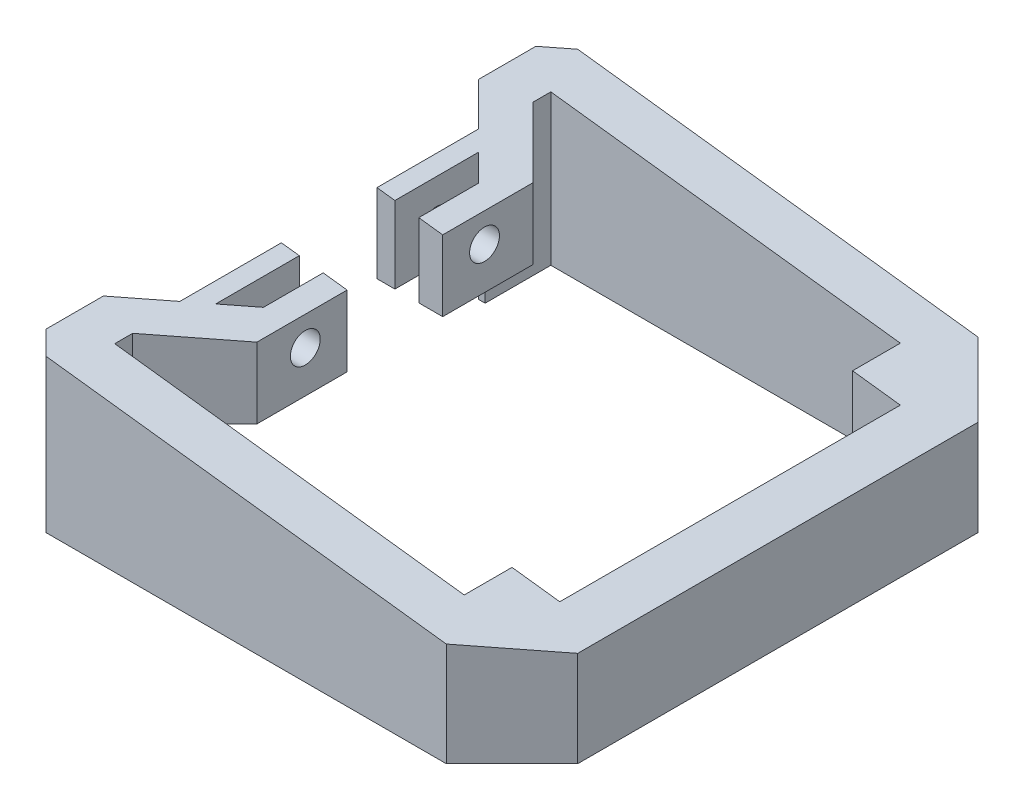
from build123d import *

# Parameters (mm, degrees)
SKETCH1_R                      = 1.1
BOSS_EXTRUDE1_DEPTH            = 6
BOSS_EXTRUDE2_DEPTH            = 7
SKETCH4_R                      = 1.25
CUT_EXTRUDE1_DEPTH             = 2
CUT_EXTRUDE3_REACH             = 55.38
SKETCH7_W                      = 8
SKETCH7_H                      = 13
CUT_EXTRUDE3_DIRECTION_2_DEPTH = 6
SKETCH8_R                      = 0.75
CUT_EXTRUDE4_DEPTH             = 2
CUT_EXTRUDE5_DEPTH             = 61.582588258
CUT_EXTRUDE6_DEPTH             = 6


with BuildPart() as part:
    # Sketch1 → Boss-Extrude1 (new body)
    with BuildSketch(Plane(origin=(0, 0, 0), x_dir=(1, 0, 0), z_dir=(0, 1, 0))):
        Polygon((39, 0), (39, -33.5), (33.5, -39), (0, -39), (-1.75, -37.25), (-1.75, -29.5), (1.45, -26.3), (1.45, -7.2), (-1.75, -4), (-1.75, 3.75), (0, 5.5), (33.5, 5.5), align=None)
        with Locations(Location((0, 0, 0), (0, 0, 270))):
            Circle(SKETCH1_R, mode=Mode.SUBTRACT)
        with Locations(Location((33.5, 0, 0), (0, 0, 270))):
            Circle(SKETCH1_R, mode=Mode.SUBTRACT)
        with Locations(Location((0, -33.5, 0), (0, 0, 270))):
            Circle(SKETCH1_R, mode=Mode.SUBTRACT)
        with Locations(Location((33.5, -33.5, 0), (0, 0, 270))):
            Circle(SKETCH1_R, mode=Mode.SUBTRACT)
        Polygon((31, 1.5), (31, -2.5), (35, -2.5), (35, -31), (31, -31), (31, -35), (1.75, -35), (1.75, -33.5), (6.95, -28.3), (6.95, -5.2), (1.75, 0), (1.75, 1.5), align=None, mode=Mode.SUBTRACT)
        Polygon((4.95, -22.8), (4.95, -10.7), (2.95, -8.7), (2.95, -24.8), align=None, mode=Mode.SUBTRACT)
    extrude(amount=BOSS_EXTRUDE1_DEPTH)

    # Sketch2 → Boss-Extrude2 (add)
    with BuildSketch(Plane(origin=(0, 6, 0), x_dir=(1, 0, 0), z_dir=(0, 1, 0))):
        Polygon((0, 5.5), (-1.75, 3.75), (-1.75, -1.05), (1.45, -4.25), (1.45, -29.25), (-1.75, -32.45), (-1.75, -37.25), (0, -39), (33.5, -39), (39, -33.5), (39, 0), (33.5, 5.5), align=None)
        Polygon((4.95, -7.75), (4.95, -25.75), (2.95, -27.75), (2.95, -5.75), align=None, mode=Mode.SUBTRACT)
        Polygon((1.75, -33.5), (1.75, -35), (31, -35), (31, -31), (35, -31), (35, -2.5), (31, -2.5), (31, 1.5), (1.75, 1.5), (1.75, 0), (6.95, -5.2), (6.95, -28.3), align=None, mode=Mode.SUBTRACT)
    extrude(amount=BOSS_EXTRUDE2_DEPTH)

    # Sketch4 → Cut-Extrude1 (cut)
    with BuildSketch(Plane(origin=(6.95, 0, 0), x_dir=(0, 0, -1), z_dir=(1, 0, 0))):
        with Locations((-24.25, 9.5)):
            Circle(SKETCH4_R)
        with Locations((-9.25, 9.5)):
            Circle(SKETCH4_R)
    extrude(amount=-CUT_EXTRUDE1_DEPTH, mode=Mode.SUBTRACT)

    # Sketch7 → Cut-Extrude3 (cut, up to next)
    with BuildSketch(Plane.ZY.offset(-4.95), mode=Mode.PRIVATE) as cut_extrude3_sk1:
        with Locations((16.75, 6.5)):
            Rectangle(SKETCH7_W, SKETCH7_H)
    cut_extrude3_tool1 = extrude(cut_extrude3_sk1.sketch, amount=-CUT_EXTRUDE3_REACH, mode=Mode.PRIVATE) & part.part
    add(cut_extrude3_tool1.solids().sort_by_distance((4.95, 6.5, 16.75))[0], mode=Mode.SUBTRACT)

    # Sketch7 → Cut-Extrude3 direction 2 (cut)
    with BuildSketch(Plane.ZY.offset(-4.95)):
        with Locations((16.75, 6.5)):
            Rectangle(SKETCH7_W, SKETCH7_H)
    extrude(amount=CUT_EXTRUDE3_DIRECTION_2_DEPTH, mode=Mode.SUBTRACT)

    # Sketch8 → Cut-Extrude4 (cut)
    with BuildSketch(Plane(origin=(2.95, 0, 0), x_dir=(0, 0, -1), z_dir=(1, 0, 0))):
        with Locations((-24.25, 9.5)):
            Circle(SKETCH8_R)
        with Locations((-9.25, 9.5)):
            Circle(SKETCH8_R)
    extrude(amount=-CUT_EXTRUDE4_DEPTH, mode=Mode.SUBTRACT)

    # Sketch9 → Cut-Extrude5 (cut, through all)
    with BuildSketch(Plane.XY.offset(39)):
        Polygon((-1.75, 13), (39, 8), (39, 13), align=None)
    extrude(amount=-CUT_EXTRUDE5_DEPTH, mode=Mode.SUBTRACT)

    # Sketch10 → Cut-Extrude6 (cut)
    with BuildSketch(Plane.XZ):
        Polygon((-1.75, 32.45), (-1.75, 29.5), (1.45, 26.3), (1.45, 7.2), (-1.75, 4), (-1.75, 1.05), (1.2, 4), (1.75, 4), (1.75, 0), (6.95, 5.2), (6.95, 28.3), (1.75, 33.5), (1.75, 29.5), (1.2, 29.5), align=None)
    extrude(amount=-CUT_EXTRUDE6_DEPTH, mode=Mode.SUBTRACT)


solid = part.part
